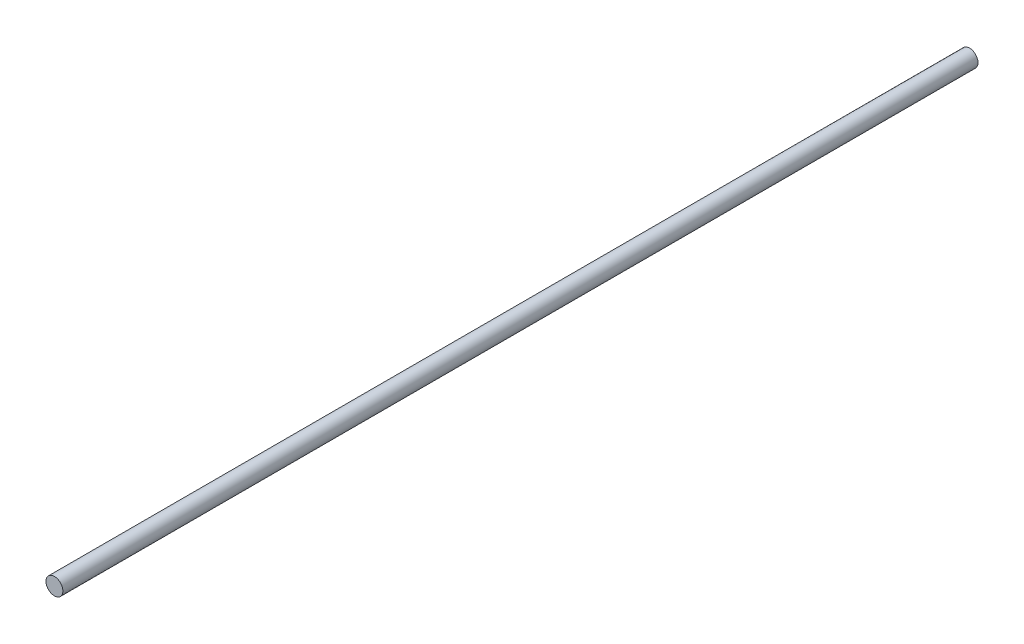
ISO-10303-21;
HEADER;
FILE_DESCRIPTION(('STEP AP214'),'2;1');
FILE_NAME('part.step','',(''),(''),'','','');
FILE_SCHEMA(('AUTOMOTIVE_DESIGN { 1 0 10303 214 1 1 1 1 }'));
ENDSEC;
DATA;
#1=APPLICATION_CONTEXT('core data for automotive mechanical design processes');
#2=APPLICATION_PROTOCOL_DEFINITION('international standard','automotive_design',2000,#1);
#3=PRODUCT_CONTEXT('',#1,'mechanical');
#4=PRODUCT('Part','Part','',(#3));
#5=PRODUCT_RELATED_PRODUCT_CATEGORY('part','',(#4));
#6=PRODUCT_DEFINITION_FORMATION('','',#4);
#7=PRODUCT_DEFINITION_CONTEXT('part definition',#1,'design');
#8=PRODUCT_DEFINITION('design','',#6,#7);
#9=PRODUCT_DEFINITION_SHAPE('','',#8);
#10=(LENGTH_UNIT() NAMED_UNIT(*) SI_UNIT(.MILLI.,.METRE.));
#11=(NAMED_UNIT(*) PLANE_ANGLE_UNIT() SI_UNIT($,.RADIAN.));
#12=(NAMED_UNIT(*) SI_UNIT($,.STERADIAN.) SOLID_ANGLE_UNIT());
#13=UNCERTAINTY_MEASURE_WITH_UNIT(LENGTH_MEASURE(1.E-05),#10,'distance_accuracy_value','');
#14=(GEOMETRIC_REPRESENTATION_CONTEXT(3) GLOBAL_UNCERTAINTY_ASSIGNED_CONTEXT((#13)) GLOBAL_UNIT_ASSIGNED_CONTEXT((#10,
#11,#12)) REPRESENTATION_CONTEXT('',''));
#15=CARTESIAN_POINT('',(0.,0.,0.));
#16=DIRECTION('',(0.,0.,1.));
#17=DIRECTION('',(1.,0.,0.));
#18=AXIS2_PLACEMENT_3D('',#15,#16,#17);
#19=CARTESIAN_POINT('',(0.,0.,-3250.));
#20=DIRECTION('',(0.,0.,1.));
#21=DIRECTION('',(1.,0.,0.));
#22=AXIS2_PLACEMENT_3D('',#19,#20,#21);
#23=CYLINDRICAL_SURFACE('',#22,30.);
#24=CARTESIAN_POINT('',(0.,0.,-3250.));
#25=DIRECTION('',(0.,0.,1.));
#26=DIRECTION('',(1.,0.,0.));
#27=AXIS2_PLACEMENT_3D('',#24,#25,#26);
#28=CIRCLE('',#27,30.);
#29=CARTESIAN_POINT('',(30.,0.,-3250.));
#30=VERTEX_POINT('',#29);
#31=EDGE_CURVE('E10',#30,#30,#28,.T.);
#32=ORIENTED_EDGE('',*,*,#31,.T.);
#33=EDGE_LOOP('',(#32));
#34=FACE_BOUND('',#33,.T.);
#35=CARTESIAN_POINT('',(0.,0.,0.));
#36=DIRECTION('',(0.,0.,1.));
#37=DIRECTION('',(1.,0.,0.));
#38=AXIS2_PLACEMENT_3D('',#35,#36,#37);
#39=CIRCLE('',#38,30.);
#40=CARTESIAN_POINT('',(30.,0.,0.));
#41=VERTEX_POINT('',#40);
#42=EDGE_CURVE('E40',#41,#41,#39,.T.);
#43=ORIENTED_EDGE('',*,*,#42,.F.);
#44=EDGE_LOOP('',(#43));
#45=FACE_BOUND('',#44,.T.);
#46=ADVANCED_FACE('F37',(#34,#45),#23,.T.);
#47=CARTESIAN_POINT('',(0.,0.,-3250.));
#48=DIRECTION('',(0.,0.,1.));
#49=DIRECTION('',(1.,0.,0.));
#50=AXIS2_PLACEMENT_3D('',#47,#48,#49);
#51=PLANE('',#50);
#52=ORIENTED_EDGE('',*,*,#31,.F.);
#53=EDGE_LOOP('',(#52));
#54=FACE_BOUND('',#53,.T.);
#55=ADVANCED_FACE('F54',(#54),#51,.F.);
#56=CARTESIAN_POINT('',(0.,0.,0.));
#57=DIRECTION('',(0.,0.,1.));
#58=DIRECTION('',(1.,0.,0.));
#59=AXIS2_PLACEMENT_3D('',#56,#57,#58);
#60=PLANE('',#59);
#61=ORIENTED_EDGE('',*,*,#42,.T.);
#62=EDGE_LOOP('',(#61));
#63=FACE_BOUND('',#62,.T.);
#64=ADVANCED_FACE('F51',(#63),#60,.T.);
#65=CLOSED_SHELL('',(#46,#55,#64));
#66=MANIFOLD_SOLID_BREP('B2',#65);
#67=ADVANCED_BREP_SHAPE_REPRESENTATION('',(#18,#66),#14);
#68=SHAPE_DEFINITION_REPRESENTATION(#9,#67);
ENDSEC;
END-ISO-10303-21;
